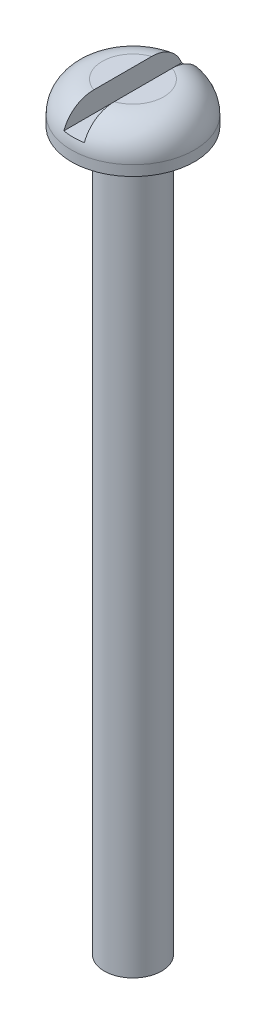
ISO-10303-21;
HEADER;
FILE_DESCRIPTION(('STEP AP214'),'2;1');
FILE_NAME('part.step','',(''),(''),'','','');
FILE_SCHEMA(('AUTOMOTIVE_DESIGN { 1 0 10303 214 1 1 1 1 }'));
ENDSEC;
DATA;
#1=APPLICATION_CONTEXT('core data for automotive mechanical design processes');
#2=APPLICATION_PROTOCOL_DEFINITION('international standard','automotive_design',2000,#1);
#3=PRODUCT_CONTEXT('',#1,'mechanical');
#4=PRODUCT('Part','Part','',(#3));
#5=PRODUCT_RELATED_PRODUCT_CATEGORY('part','',(#4));
#6=PRODUCT_DEFINITION_FORMATION('','',#4);
#7=PRODUCT_DEFINITION_CONTEXT('part definition',#1,'design');
#8=PRODUCT_DEFINITION('design','',#6,#7);
#9=PRODUCT_DEFINITION_SHAPE('','',#8);
#10=(LENGTH_UNIT() NAMED_UNIT(*) SI_UNIT(.MILLI.,.METRE.));
#11=(NAMED_UNIT(*) PLANE_ANGLE_UNIT() SI_UNIT($,.RADIAN.));
#12=(NAMED_UNIT(*) SI_UNIT($,.STERADIAN.) SOLID_ANGLE_UNIT());
#13=UNCERTAINTY_MEASURE_WITH_UNIT(LENGTH_MEASURE(1.E-05),#10,'distance_accuracy_value','');
#14=(GEOMETRIC_REPRESENTATION_CONTEXT(3) GLOBAL_UNCERTAINTY_ASSIGNED_CONTEXT((#13)) GLOBAL_UNIT_ASSIGNED_CONTEXT((#10,
#11,#12)) REPRESENTATION_CONTEXT('',''));
#15=CARTESIAN_POINT('',(0.,0.,0.));
#16=DIRECTION('',(0.,0.,1.));
#17=DIRECTION('',(1.,0.,0.));
#18=AXIS2_PLACEMENT_3D('',#15,#16,#17);
#19=CARTESIAN_POINT('',(-2.99999999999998,10.4,0.));
#20=DIRECTION('',(0.,1.,0.));
#21=DIRECTION('',(0.,0.,1.));
#22=AXIS2_PLACEMENT_3D('',#19,#20,#21);
#23=PLANE('',#22);
#24=DIRECTION('',(0.,0.,1.));
#25=VECTOR('',#24,1.);
#26=CARTESIAN_POINT('',(-1.,10.4,0.));
#27=LINE('',#26,#25);
#28=CARTESIAN_POINT('',(-1.,10.4,-2.82842712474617));
#29=VERTEX_POINT('',#28);
#30=CARTESIAN_POINT('',(-1.,10.4,2.82842712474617));
#31=VERTEX_POINT('',#30);
#32=EDGE_CURVE('E58',#29,#31,#27,.T.);
#33=ORIENTED_EDGE('',*,*,#32,.F.);
#34=CARTESIAN_POINT('',(0.,10.4,0.));
#35=DIRECTION('',(0.,1.,0.));
#36=DIRECTION('',(0.,0.,1.));
#37=AXIS2_PLACEMENT_3D('',#34,#35,#36);
#38=CIRCLE('',#37,2.99999999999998);
#39=EDGE_CURVE('E93',#29,#31,#38,.T.);
#40=ORIENTED_EDGE('',*,*,#39,.T.);
#41=EDGE_LOOP('',(#33,#40));
#42=FACE_BOUND('',#41,.T.);
#43=ADVANCED_FACE('F31',(#42),#23,.T.);
#44=CARTESIAN_POINT('',(0.,-63.6,0.));
#45=DIRECTION('',(0.,1.,0.));
#46=DIRECTION('',(0.,0.,1.));
#47=AXIS2_PLACEMENT_3D('',#44,#45,#46);
#48=CYLINDRICAL_SURFACE('',#47,2.8);
#49=CARTESIAN_POINT('',(0.,-63.6,0.));
#50=DIRECTION('',(0.,1.,0.));
#51=DIRECTION('',(0.,0.,1.));
#52=AXIS2_PLACEMENT_3D('',#49,#50,#51);
#53=CIRCLE('',#52,2.8);
#54=CARTESIAN_POINT('',(0.,-63.6,2.8));
#55=VERTEX_POINT('',#54);
#56=EDGE_CURVE('E84',#55,#55,#53,.T.);
#57=ORIENTED_EDGE('',*,*,#56,.T.);
#58=EDGE_LOOP('',(#57));
#59=FACE_BOUND('',#58,.T.);
#60=CARTESIAN_POINT('',(0.,6.4,0.));
#61=DIRECTION('',(0.,1.,0.));
#62=DIRECTION('',(0.,0.,1.));
#63=AXIS2_PLACEMENT_3D('',#60,#61,#62);
#64=CIRCLE('',#63,2.8);
#65=CARTESIAN_POINT('',(0.,6.4,2.8));
#66=VERTEX_POINT('',#65);
#67=EDGE_CURVE('E108',#66,#66,#64,.T.);
#68=ORIENTED_EDGE('',*,*,#67,.F.);
#69=EDGE_LOOP('',(#68));
#70=FACE_BOUND('',#69,.T.);
#71=ADVANCED_FACE('F33',(#59,#70),#48,.T.);
#72=CARTESIAN_POINT('',(0.,-63.6,0.));
#73=DIRECTION('',(0.,1.,0.));
#74=DIRECTION('',(0.,0.,1.));
#75=AXIS2_PLACEMENT_3D('',#72,#73,#74);
#76=PLANE('',#75);
#77=ORIENTED_EDGE('',*,*,#56,.F.);
#78=EDGE_LOOP('',(#77));
#79=FACE_BOUND('',#78,.T.);
#80=ADVANCED_FACE('F121',(#79),#76,.F.);
#81=DIRECTION('',(0.,0.,-1.));
#82=VECTOR('',#81,1.);
#83=CARTESIAN_POINT('',(1.,10.4,0.));
#84=LINE('',#83,#82);
#85=CARTESIAN_POINT('',(1.,10.4,2.82842712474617));
#86=VERTEX_POINT('',#85);
#87=CARTESIAN_POINT('',(1.,10.4,-2.82842712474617));
#88=VERTEX_POINT('',#87);
#89=EDGE_CURVE('E101',#86,#88,#84,.T.);
#90=ORIENTED_EDGE('',*,*,#89,.F.);
#91=EDGE_CURVE('E106',#86,#88,#38,.T.);
#92=ORIENTED_EDGE('',*,*,#91,.T.);
#93=EDGE_LOOP('',(#90,#92));
#94=FACE_BOUND('',#93,.T.);
#95=ADVANCED_FACE('F105',(#94),#23,.T.);
#96=CARTESIAN_POINT('',(0.,7.4,0.));
#97=DIRECTION('',(0.,1.,0.));
#98=DIRECTION('',(0.,0.,1.));
#99=AXIS2_PLACEMENT_3D('',#96,#97,#98);
#100=DEGENERATE_TOROIDAL_SURFACE('',#99,3.,3.,.T.);
#101=CARTESIAN_POINT('',(-1.,9.63606797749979,0.));
#102=CARTESIAN_POINT('',(-1.,9.63606832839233,0.0347573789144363));
#103=CARTESIAN_POINT('',(-1.,9.63770284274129,0.0695160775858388));
#104=CARTESIAN_POINT('',(-1.,9.64408287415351,0.138755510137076));
#105=CARTESIAN_POINT('',(-1.,9.6488301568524,0.173236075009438));
#106=CARTESIAN_POINT('',(-1.,9.66716719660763,0.276081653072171));
#107=CARTESIAN_POINT('',(-1.,9.68484951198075,0.343712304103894));
#108=CARTESIAN_POINT('',(-1.,9.71717923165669,0.4461027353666));
#109=CARTESIAN_POINT('',(-1.,9.72948627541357,0.48168390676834));
#110=CARTESIAN_POINT('',(-1.,9.75545837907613,0.552350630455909));
#111=CARTESIAN_POINT('',(-1.,9.76912329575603,0.587436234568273));
#112=CARTESIAN_POINT('',(-1.,9.81145913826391,0.692267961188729));
#113=CARTESIAN_POINT('',(-1.,9.84143179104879,0.761475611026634));
#114=CARTESIAN_POINT('',(-1.,9.90253859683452,0.900503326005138));
#115=CARTESIAN_POINT('',(-1.,9.93368307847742,0.970318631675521));
#116=CARTESIAN_POINT('',(-1.,9.99499645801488,1.11038321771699));
#117=CARTESIAN_POINT('',(-1.,10.0251653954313,1.18063248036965));
#118=CARTESIAN_POINT('',(-1.,10.0833182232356,1.32194271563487));
#119=CARTESIAN_POINT('',(-1.,10.1113046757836,1.39300262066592));
#120=CARTESIAN_POINT('',(-1.,10.164299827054,1.53623261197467));
#121=CARTESIAN_POINT('',(-1.,10.1893085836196,1.6084026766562));
#122=CARTESIAN_POINT('',(-1.,10.2355782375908,1.75344944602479));
#123=CARTESIAN_POINT('',(-1.,10.2568615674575,1.82631892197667));
#124=CARTESIAN_POINT('',(-1.,10.2953971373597,1.97311635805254));
#125=CARTESIAN_POINT('',(-1.,10.3126491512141,2.04704437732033));
#126=CARTESIAN_POINT('',(-1.,10.3577711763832,2.27017730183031));
#127=CARTESIAN_POINT('',(-1.,10.3790271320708,2.42079171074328));
#128=CARTESIAN_POINT('',(-1.,10.4038018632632,2.75165591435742));
#129=CARTESIAN_POINT('',(-1.,10.4033074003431,2.9322290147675));
#130=CARTESIAN_POINT('',(-1.,10.3725931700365,3.29154287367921));
#131=CARTESIAN_POINT('',(-1.,10.3422683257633,3.47027489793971));
#132=CARTESIAN_POINT('',(-1.,10.2514159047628,3.82025138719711));
#133=CARTESIAN_POINT('',(-1.,10.1908401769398,3.99148344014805));
#134=CARTESIAN_POINT('',(-1.,10.0406941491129,4.32048796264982));
#135=CARTESIAN_POINT('',(-1.,9.95116388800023,4.47827864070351));
#136=CARTESIAN_POINT('',(-1.,9.74943602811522,4.76974559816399));
#137=CARTESIAN_POINT('',(-1.,9.63823763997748,4.90411388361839));
#138=CARTESIAN_POINT('',(-1.,9.39426259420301,5.15168172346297));
#139=CARTESIAN_POINT('',(-1.,9.26148081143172,5.26487623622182));
#140=CARTESIAN_POINT('',(-1.,8.98205370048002,5.46375896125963));
#141=CARTESIAN_POINT('',(-1.,8.83587335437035,5.55010106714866));
#142=CARTESIAN_POINT('',(-1.,8.53097970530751,5.69666959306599));
#143=CARTESIAN_POINT('',(-1.,8.37226882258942,5.75690104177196));
#144=CARTESIAN_POINT('',(-1.,8.0488196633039,5.8488888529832));
#145=CARTESIAN_POINT('',(-1.,7.88417400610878,5.88097116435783));
#146=CARTESIAN_POINT('',(-1.,7.55182648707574,5.91690424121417));
#147=CARTESIAN_POINT('',(-1.,7.38412463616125,5.92075510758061));
#148=CARTESIAN_POINT('',(-1.,7.05121938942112,5.90015560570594));
#149=CARTESIAN_POINT('',(-1.,6.8860082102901,5.87583071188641));
#150=CARTESIAN_POINT('',(-1.,6.56201500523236,5.7998066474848));
#151=CARTESIAN_POINT('',(-1.,6.403232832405,5.74810810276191));
#152=CARTESIAN_POINT('',(-1.,6.09646302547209,5.61881807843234));
#153=CARTESIAN_POINT('',(-1.,5.94848281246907,5.5412089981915));
#154=CARTESIAN_POINT('',(-1.,5.66754684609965,5.36238488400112));
#155=CARTESIAN_POINT('',(-1.,5.53459196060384,5.26116848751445));
#156=CARTESIAN_POINT('',(-1.,5.28656849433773,5.0373998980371));
#157=CARTESIAN_POINT('',(-1.,5.17161437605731,4.91472090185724));
#158=CARTESIAN_POINT('',(-1.,4.96362987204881,4.65205748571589));
#159=CARTESIAN_POINT('',(-1.,4.87059580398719,4.51207597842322));
#160=CARTESIAN_POINT('',(-1.,4.70756140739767,4.21678709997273));
#161=CARTESIAN_POINT('',(-1.,4.63789724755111,4.06129462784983));
#162=CARTESIAN_POINT('',(-1.,4.52478348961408,3.74086162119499));
#163=CARTESIAN_POINT('',(-1.,4.48135615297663,3.57591319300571));
#164=CARTESIAN_POINT('',(-1.,4.43577628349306,3.32243719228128));
#165=CARTESIAN_POINT('',(-1.,4.42381973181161,3.23554798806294));
#166=CARTESIAN_POINT('',(-1.,4.40692467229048,3.06107219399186));
#167=CARTESIAN_POINT('',(-1.,4.40198614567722,2.9734856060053));
#168=CARTESIAN_POINT('',(-1.,4.39899729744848,2.79845997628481));
#169=CARTESIAN_POINT('',(-1.,4.40092695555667,2.71102124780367));
#170=CARTESIAN_POINT('',(-1.,4.4113882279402,2.53654048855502));
#171=CARTESIAN_POINT('',(-1.,4.41992057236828,2.44949850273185));
#172=CARTESIAN_POINT('',(-1.,4.44825139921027,2.23923553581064));
#173=CARTESIAN_POINT('',(-1.,4.47130585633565,2.1164462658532));
#174=CARTESIAN_POINT('',(-1.,4.52883714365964,1.87359527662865));
#175=CARTESIAN_POINT('',(-1.,4.56331696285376,1.75353427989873));
#176=CARTESIAN_POINT('',(-1.,4.62221533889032,1.5752245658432));
#177=CARTESIAN_POINT('',(-1.,4.64316696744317,1.51579395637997));
#178=CARTESIAN_POINT('',(-1.,4.68707482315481,1.3976767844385));
#179=CARTESIAN_POINT('',(-1.,4.71003106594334,1.33899022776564));
#180=CARTESIAN_POINT('',(-1.,4.75748504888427,1.22225948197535));
#181=CARTESIAN_POINT('',(-1.,4.78198258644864,1.1642152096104));
#182=CARTESIAN_POINT('',(-1.,4.83191739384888,1.04852857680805));
#183=CARTESIAN_POINT('',(-1.,4.85735476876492,0.990886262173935));
#184=CARTESIAN_POINT('',(-1.,4.90965439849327,0.872679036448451));
#185=CARTESIAN_POINT('',(-1.,4.93652245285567,0.8121167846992));
#186=CARTESIAN_POINT('',(-1.,4.98900952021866,0.69036779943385));
#187=CARTESIAN_POINT('',(-1.,5.01462730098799,0.629180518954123));
#188=CARTESIAN_POINT('',(-1.,5.06212726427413,0.506340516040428));
#189=CARTESIAN_POINT('',(-1.,5.08405778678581,0.444707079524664));
#190=CARTESIAN_POINT('',(-1.,5.12154538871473,0.31954596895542));
#191=CARTESIAN_POINT('',(-1.,5.13711852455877,0.256023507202));
#192=CARTESIAN_POINT('',(-1.,5.15343419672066,0.157569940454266));
#193=CARTESIAN_POINT('',(-1.,5.15770699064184,0.123230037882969));
#194=CARTESIAN_POINT('',(-1.,5.16313641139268,0.0542936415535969));
#195=CARTESIAN_POINT('',(-1.,5.16429281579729,0.0196971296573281));
#196=CARTESIAN_POINT('',(-1.,5.16337290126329,-0.0494804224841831));
#197=CARTESIAN_POINT('',(-1.,5.16129388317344,-0.0840614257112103));
#198=CARTESIAN_POINT('',(-1.,5.15409804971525,-0.152894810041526));
#199=CARTESIAN_POINT('',(-1.,5.14898131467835,-0.187147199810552));
#200=CARTESIAN_POINT('',(-1.,5.13015334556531,-0.286751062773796));
#201=CARTESIAN_POINT('',(-1.,5.11287417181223,-0.351418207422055));
#202=CARTESIAN_POINT('',(-1.,5.07230890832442,-0.478851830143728));
#203=CARTESIAN_POINT('',(-1.,5.04900843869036,-0.541613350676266));
#204=CARTESIAN_POINT('',(-1.,4.99913520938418,-0.66673541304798));
#205=CARTESIAN_POINT('',(-1.,4.97252384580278,-0.729080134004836));
#206=CARTESIAN_POINT('',(-1.,4.91836683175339,-0.853282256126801));
#207=CARTESIAN_POINT('',(-1.,4.89082205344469,-0.915140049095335));
#208=CARTESIAN_POINT('',(-1.,4.83624958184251,-1.0387807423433));
#209=CARTESIAN_POINT('',(-1.,4.80922021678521,-1.10056288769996));
#210=CARTESIAN_POINT('',(-1.,4.75648944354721,-1.22468685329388));
#211=CARTESIAN_POINT('',(-1.,4.73078784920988,-1.28702859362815));
#212=CARTESIAN_POINT('',(-1.,4.68138225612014,-1.41249925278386));
#213=CARTESIAN_POINT('',(-1.,4.65767803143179,-1.47562808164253));
#214=CARTESIAN_POINT('',(-1.,4.61276045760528,-1.60279691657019));
#215=CARTESIAN_POINT('',(-1.,4.59154824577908,-1.66683732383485));
#216=CARTESIAN_POINT('',(-1.,4.53266048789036,-1.85908765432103));
#217=CARTESIAN_POINT('',(-1.,4.49923620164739,-1.98864724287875));
#218=CARTESIAN_POINT('',(-1.,4.446117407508,-2.25057624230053));
#219=CARTESIAN_POINT('',(-1.,4.42641891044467,-2.38294482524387));
#220=CARTESIAN_POINT('',(-1.,4.40605842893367,-2.60646426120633));
#221=CARTESIAN_POINT('',(-1.,4.40132276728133,-2.69725619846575));
#222=CARTESIAN_POINT('',(-1.,4.39915855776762,-2.8789254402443));
#223=CARTESIAN_POINT('',(-1.,4.40172874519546,-2.96980272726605));
#224=CARTESIAN_POINT('',(-1.,4.41439313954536,-3.15129057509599));
#225=CARTESIAN_POINT('',(-1.,4.4245083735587,-3.24189967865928));
#226=CARTESIAN_POINT('',(-1.,4.45238465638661,-3.4219422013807));
#227=CARTESIAN_POINT('',(-1.,4.47014599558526,-3.511375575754));
#228=CARTESIAN_POINT('',(-1.,4.51335690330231,-3.68854041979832));
#229=CARTESIAN_POINT('',(-1.,4.53882028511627,-3.77626852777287));
#230=CARTESIAN_POINT('',(-1.,4.59734508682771,-3.94919111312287));
#231=CARTESIAN_POINT('',(-1.,4.63040939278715,-4.03438461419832));
#232=CARTESIAN_POINT('',(-1.,4.70391999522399,-4.20141723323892));
#233=CARTESIAN_POINT('',(-1.,4.74435770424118,-4.28326011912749));
#234=CARTESIAN_POINT('',(-1.,4.83237615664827,-4.44302016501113));
#235=CARTESIAN_POINT('',(-1.,4.8799594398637,-4.52093591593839));
#236=CARTESIAN_POINT('',(-1.,5.02827020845,-4.74081279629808));
#237=CARTESIAN_POINT('',(-1.,5.138074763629,-4.87681149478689));
#238=CARTESIAN_POINT('',(-1.,5.3795008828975,-5.12771781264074));
#239=CARTESIAN_POINT('',(-1.,5.51112232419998,-5.24262555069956));
#240=CARTESIAN_POINT('',(-1.,5.78847892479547,-5.44496493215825));
#241=CARTESIAN_POINT('',(-1.,5.93372445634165,-5.53306721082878));
#242=CARTESIAN_POINT('',(-1.,6.23707199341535,-5.68328014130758));
#243=CARTESIAN_POINT('',(-1.,6.39517242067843,-5.74539397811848));
#244=CARTESIAN_POINT('',(-1.,6.71768010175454,-5.84117013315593));
#245=CARTESIAN_POINT('',(-1.,6.88198785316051,-5.87516773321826));
#246=CARTESIAN_POINT('',(-1.,7.2139841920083,-5.91495403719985));
#247=CARTESIAN_POINT('',(-1.,7.38167269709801,-5.92074342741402));
#248=CARTESIAN_POINT('',(-1.,7.71484518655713,-5.90398074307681));
#249=CARTESIAN_POINT('',(-1.,7.88033578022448,-5.88155963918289));
#250=CARTESIAN_POINT('',(-1.,8.20520274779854,-5.80926441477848));
#251=CARTESIAN_POINT('',(-1.,8.36457923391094,-5.75939079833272));
#252=CARTESIAN_POINT('',(-1.,8.67280611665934,-5.63363023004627));
#253=CARTESIAN_POINT('',(-1.,8.82165106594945,-5.55772993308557));
#254=CARTESIAN_POINT('',(-1.,9.1045853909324,-5.38215097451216));
#255=CARTESIAN_POINT('',(-1.,9.23867399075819,-5.28247106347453));
#256=CARTESIAN_POINT('',(-1.,9.48917755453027,-5.06159008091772));
#257=CARTESIAN_POINT('',(-1.,9.60548349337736,-4.94026541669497));
#258=CARTESIAN_POINT('',(-1.,9.81637064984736,-4.68006511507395));
#259=CARTESIAN_POINT('',(-1.,9.91095512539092,-4.54119211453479));
#260=CARTESIAN_POINT('',(-1.,10.0772293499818,-4.24788414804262));
#261=CARTESIAN_POINT('',(-1.,10.1485929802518,-4.09326449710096));
#262=CARTESIAN_POINT('',(-1.,10.2651975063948,-3.77437481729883));
#263=CARTESIAN_POINT('',(-1.,10.3104184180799,-3.61009751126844));
#264=CARTESIAN_POINT('',(-1.,10.3751522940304,-3.27138430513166));
#265=CARTESIAN_POINT('',(-1.,10.3938375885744,-3.0967913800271));
#266=CARTESIAN_POINT('',(-1.,10.4035552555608,-2.7473165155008));
#267=CARTESIAN_POINT('',(-1.,10.3946547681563,-2.57243631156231));
#268=CARTESIAN_POINT('',(-1.,10.3580215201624,-2.27781817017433));
#269=CARTESIAN_POINT('',(-1.,10.3367107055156,-2.15721771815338));
#270=CARTESIAN_POINT('',(-1.,10.2829450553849,-1.9185127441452));
#271=CARTESIAN_POINT('',(-1.,10.2504874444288,-1.80040885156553));
#272=CARTESIAN_POINT('',(-1.,10.1759154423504,-1.56619947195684));
#273=CARTESIAN_POINT('',(-1.,10.133717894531,-1.45012102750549));
#274=CARTESIAN_POINT('',(-1.,10.0654960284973,-1.27803012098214));
#275=CARTESIAN_POINT('',(-1.,10.0419365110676,-1.22100864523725));
#276=CARTESIAN_POINT('',(-1.,9.99370728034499,-1.10742790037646));
#277=CARTESIAN_POINT('',(-1.,9.96903741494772,-1.05086869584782));
#278=CARTESIAN_POINT('',(-1.,9.91532500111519,-0.928972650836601));
#279=CARTESIAN_POINT('',(-1.,9.88621026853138,-0.863668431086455));
#280=CARTESIAN_POINT('',(-1.,9.82893394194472,-0.73252369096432));
#281=CARTESIAN_POINT('',(-1.,9.80077368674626,-0.66668256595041));
#282=CARTESIAN_POINT('',(-1.,9.74820261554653,-0.534431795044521));
#283=CARTESIAN_POINT('',(-1.,9.72374927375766,-0.468039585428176));
#284=CARTESIAN_POINT('',(-1.,9.6818989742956,-0.333081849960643));
#285=CARTESIAN_POINT('',(-1.,9.6644808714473,-0.264523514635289));
#286=CARTESIAN_POINT('',(-1.,9.64735225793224,-0.162811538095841));
#287=CARTESIAN_POINT('',(-1.,9.64315574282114,-0.130420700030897));
#288=CARTESIAN_POINT('',(-1.,9.63751175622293,-0.0653538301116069));
#289=CARTESIAN_POINT('',(-1.,9.63606764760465,-0.0326774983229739));
#290=CARTESIAN_POINT('',(-1.,9.63606797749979,0.));
#291=B_SPLINE_CURVE_WITH_KNOTS('',3,(#101,#102,#103,#104,#105,#106,#107,#108,#109,#110,#111,
#112,#113,#114,#115,#116,#117,#118,#119,#120,#121,#122,#123,#124,#125,#126,#127,#128,#129,#130,
#131,#132,#133,#134,#135,#136,#137,#138,#139,#140,#141,#142,#143,#144,#145,#146,#147,#148,#149,
#150,#151,#152,#153,#154,#155,#156,#157,#158,#159,#160,#161,#162,#163,#164,#165,#166,#167,#168,
#169,#170,#171,#172,#173,#174,#175,#176,#177,#178,#179,#180,#181,#182,#183,#184,#185,#186,#187,
#188,#189,#190,#191,#192,#193,#194,#195,#196,#197,#198,#199,#200,#201,#202,#203,#204,#205,#206,
#207,#208,#209,#210,#211,#212,#213,#214,#215,#216,#217,#218,#219,#220,#221,#222,#223,#224,#225,
#226,#227,#228,#229,#230,#231,#232,#233,#234,#235,#236,#237,#238,#239,#240,#241,#242,#243,#244,
#245,#246,#247,#248,#249,#250,#251,#252,#253,#254,#255,#256,#257,#258,#259,#260,#261,#262,#263,
#264,#265,#266,#267,#268,#269,#270,#271,#272,#273,#274,#275,#276,#277,#278,#279,#280,#281,#282,
#283,#284,#285,#286,#287,#288,#289,#290),.UNSPECIFIED.,.T.,.F.,(4,2,2,2,2,2,2,2,2,2,2,2,2,2,2,2,
2,2,2,2,2,2,2,2,2,2,2,2,2,2,2,2,2,2,2,2,2,2,2,2,2,2,2,2,2,2,2,2,2,2,2,2,2,2,2,2,2,2,2,2,2,2,2,2,
2,2,2,2,2,2,2,2,2,2,2,2,2,2,2,2,2,2,2,2,2,2,2,2,2,2,2,2,2,2,4),(0.,0.104237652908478,
0.208534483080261,0.417537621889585,0.530480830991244,0.643412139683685,0.869634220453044,
1.09898354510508,1.32832356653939,1.55739016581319,1.78645231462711,2.01408380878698,
2.2417280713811,2.69682624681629,3.23619534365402,3.77747118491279,4.31961134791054,
4.86100501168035,5.38166842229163,5.9024556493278,6.40933371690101,6.91611412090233,
7.41694580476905,7.91777569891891,8.41638380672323,8.91498051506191,9.41391660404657,
9.91288149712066,10.4149005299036,10.9168351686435,11.425707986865,11.935011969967,
12.1978990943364,12.4607855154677,12.7229062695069,12.9850560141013,13.3592114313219,
13.7334648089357,13.9224808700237,14.1114984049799,14.3004911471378,14.4895050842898,
14.6882714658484,14.8872299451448,15.0833327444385,15.2789371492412,15.3826261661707,
15.4863225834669,15.5901055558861,15.6938857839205,15.8941229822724,16.0948428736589,
16.2981722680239,16.5013166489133,16.7036178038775,16.9058905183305,17.1081403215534,
17.3104820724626,17.7112243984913,18.1118502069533,18.384330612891,18.6567638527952,
18.9299591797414,19.2031648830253,19.476863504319,19.750666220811,20.0241520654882,
20.297735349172,20.8192967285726,21.3408551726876,21.848022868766,22.3551283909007,
22.8560958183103,23.3570510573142,23.8556891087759,24.3543180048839,24.8532029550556,
25.352114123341,25.853971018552,26.3557525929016,26.8643043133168,27.3732442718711,
27.8977339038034,28.4209480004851,28.7878210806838,29.1547855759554,29.5250072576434,
29.7100892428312,29.8951966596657,30.1097037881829,30.3245002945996,30.5366077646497,
30.7480728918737,30.8459534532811,30.9439535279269),.UNSPECIFIED.);
#292=CARTESIAN_POINT('',(-1.,8.39519293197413,5.74372035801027));
#293=VERTEX_POINT('',#292);
#294=EDGE_CURVE('E11',#31,#293,#291,.T.);
#295=ORIENTED_EDGE('',*,*,#294,.F.);
#296=ORIENTED_EDGE('',*,*,#39,.F.);
#297=CARTESIAN_POINT('',(-1.,8.39519293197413,-5.74372035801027));
#298=VERTEX_POINT('',#297);
#299=EDGE_CURVE('E35',#298,#29,#291,.T.);
#300=ORIENTED_EDGE('',*,*,#299,.F.);
#301=CARTESIAN_POINT('',(0.,8.39519293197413,0.));
#302=DIRECTION('',(0.,-1.,0.));
#303=DIRECTION('',(0.,0.,-1.));
#304=AXIS2_PLACEMENT_3D('',#301,#302,#303);
#305=CIRCLE('',#304,5.83012208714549);
#306=CARTESIAN_POINT('',(1.,8.39519293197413,-5.74372035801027));
#307=VERTEX_POINT('',#306);
#308=EDGE_CURVE('E75',#307,#298,#305,.F.);
#309=ORIENTED_EDGE('',*,*,#308,.F.);
#310=CARTESIAN_POINT('',(1.,9.63606797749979,0.));
#311=CARTESIAN_POINT('',(1.,9.63606832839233,-0.0347573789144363));
#312=CARTESIAN_POINT('',(1.,9.63770284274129,-0.0695160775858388));
#313=CARTESIAN_POINT('',(1.,9.64408287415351,-0.138755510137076));
#314=CARTESIAN_POINT('',(1.,9.6488301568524,-0.173236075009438));
#315=CARTESIAN_POINT('',(1.,9.66716719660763,-0.276081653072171));
#316=CARTESIAN_POINT('',(1.,9.68484951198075,-0.343712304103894));
#317=CARTESIAN_POINT('',(1.,9.71717923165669,-0.4461027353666));
#318=CARTESIAN_POINT('',(1.,9.72948627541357,-0.48168390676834));
#319=CARTESIAN_POINT('',(1.,9.75545837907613,-0.55235063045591));
#320=CARTESIAN_POINT('',(1.,9.76912329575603,-0.587436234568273));
#321=CARTESIAN_POINT('',(1.,9.81145913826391,-0.69226796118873));
#322=CARTESIAN_POINT('',(1.,9.84143179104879,-0.761475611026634));
#323=CARTESIAN_POINT('',(1.,9.90253859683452,-0.900503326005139));
#324=CARTESIAN_POINT('',(1.,9.93368307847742,-0.970318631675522));
#325=CARTESIAN_POINT('',(1.,9.99499645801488,-1.11038321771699));
#326=CARTESIAN_POINT('',(1.,10.0251653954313,-1.18063248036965));
#327=CARTESIAN_POINT('',(1.,10.0833182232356,-1.32194271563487));
#328=CARTESIAN_POINT('',(1.,10.1113046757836,-1.39300262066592));
#329=CARTESIAN_POINT('',(1.,10.164299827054,-1.53623261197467));
#330=CARTESIAN_POINT('',(1.,10.1893085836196,-1.6084026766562));
#331=CARTESIAN_POINT('',(1.,10.2355782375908,-1.75344944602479));
#332=CARTESIAN_POINT('',(1.,10.2568615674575,-1.82631892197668));
#333=CARTESIAN_POINT('',(1.,10.2953971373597,-1.97311635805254));
#334=CARTESIAN_POINT('',(1.,10.3126491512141,-2.04704437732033));
#335=CARTESIAN_POINT('',(1.,10.3577711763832,-2.27017730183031));
#336=CARTESIAN_POINT('',(1.,10.3790271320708,-2.42079171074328));
#337=CARTESIAN_POINT('',(1.,10.4038018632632,-2.75165591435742));
#338=CARTESIAN_POINT('',(1.,10.4033074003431,-2.93222901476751));
#339=CARTESIAN_POINT('',(1.,10.3725931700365,-3.29154287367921));
#340=CARTESIAN_POINT('',(1.,10.3422683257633,-3.47027489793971));
#341=CARTESIAN_POINT('',(1.,10.2514159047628,-3.82025138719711));
#342=CARTESIAN_POINT('',(1.,10.1908401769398,-3.99148344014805));
#343=CARTESIAN_POINT('',(1.,10.0406941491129,-4.32048796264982));
#344=CARTESIAN_POINT('',(1.,9.95116388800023,-4.47827864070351));
#345=CARTESIAN_POINT('',(1.,9.74943602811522,-4.76974559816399));
#346=CARTESIAN_POINT('',(1.,9.63823763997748,-4.90411388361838));
#347=CARTESIAN_POINT('',(1.,9.39426259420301,-5.15168172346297));
#348=CARTESIAN_POINT('',(1.,9.26148081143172,-5.26487623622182));
#349=CARTESIAN_POINT('',(1.,8.98205370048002,-5.46375896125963));
#350=CARTESIAN_POINT('',(1.,8.83587335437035,-5.55010106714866));
#351=CARTESIAN_POINT('',(1.,8.53097970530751,-5.69666959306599));
#352=CARTESIAN_POINT('',(1.,8.37226882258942,-5.75690104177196));
#353=CARTESIAN_POINT('',(1.,8.0488196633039,-5.8488888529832));
#354=CARTESIAN_POINT('',(1.,7.88417400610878,-5.88097116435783));
#355=CARTESIAN_POINT('',(1.,7.55182648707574,-5.91690424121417));
#356=CARTESIAN_POINT('',(1.,7.38412463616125,-5.92075510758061));
#357=CARTESIAN_POINT('',(1.,7.05121938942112,-5.90015560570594));
#358=CARTESIAN_POINT('',(1.,6.8860082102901,-5.87583071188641));
#359=CARTESIAN_POINT('',(1.,6.56201500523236,-5.7998066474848));
#360=CARTESIAN_POINT('',(1.,6.403232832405,-5.74810810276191));
#361=CARTESIAN_POINT('',(1.,6.09646302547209,-5.61881807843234));
#362=CARTESIAN_POINT('',(1.,5.94848281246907,-5.5412089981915));
#363=CARTESIAN_POINT('',(1.,5.66754684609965,-5.36238488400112));
#364=CARTESIAN_POINT('',(1.,5.53459196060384,-5.26116848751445));
#365=CARTESIAN_POINT('',(1.,5.28656849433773,-5.0373998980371));
#366=CARTESIAN_POINT('',(1.,5.17161437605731,-4.91472090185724));
#367=CARTESIAN_POINT('',(1.,4.96362987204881,-4.6520574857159));
#368=CARTESIAN_POINT('',(1.,4.87059580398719,-4.51207597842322));
#369=CARTESIAN_POINT('',(1.,4.70756140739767,-4.21678709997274));
#370=CARTESIAN_POINT('',(1.,4.63789724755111,-4.06129462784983));
#371=CARTESIAN_POINT('',(1.,4.52478348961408,-3.74086162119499));
#372=CARTESIAN_POINT('',(1.,4.48135615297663,-3.57591319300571));
#373=CARTESIAN_POINT('',(1.,4.43577628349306,-3.32243719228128));
#374=CARTESIAN_POINT('',(1.,4.42381973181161,-3.23554798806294));
#375=CARTESIAN_POINT('',(1.,4.40692467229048,-3.06107219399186));
#376=CARTESIAN_POINT('',(1.,4.40198614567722,-2.9734856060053));
#377=CARTESIAN_POINT('',(1.,4.39899729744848,-2.79845997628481));
#378=CARTESIAN_POINT('',(1.,4.40092695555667,-2.71102124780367));
#379=CARTESIAN_POINT('',(1.,4.4113882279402,-2.53654048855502));
#380=CARTESIAN_POINT('',(1.,4.41992057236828,-2.44949850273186));
#381=CARTESIAN_POINT('',(1.,4.44825139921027,-2.23923553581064));
#382=CARTESIAN_POINT('',(1.,4.47130585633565,-2.1164462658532));
#383=CARTESIAN_POINT('',(1.,4.52883714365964,-1.87359527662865));
#384=CARTESIAN_POINT('',(1.,4.56331696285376,-1.75353427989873));
#385=CARTESIAN_POINT('',(1.,4.62221533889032,-1.57522456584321));
#386=CARTESIAN_POINT('',(1.,4.64316696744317,-1.51579395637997));
#387=CARTESIAN_POINT('',(1.,4.6870748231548,-1.3976767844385));
#388=CARTESIAN_POINT('',(1.,4.71003106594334,-1.33899022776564));
#389=CARTESIAN_POINT('',(1.,4.75748504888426,-1.22225948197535));
#390=CARTESIAN_POINT('',(1.,4.78198258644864,-1.16421520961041));
#391=CARTESIAN_POINT('',(1.,4.83191739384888,-1.04852857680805));
#392=CARTESIAN_POINT('',(1.,4.85735476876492,-0.990886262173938));
#393=CARTESIAN_POINT('',(1.,4.90965439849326,-0.872679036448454));
#394=CARTESIAN_POINT('',(1.,4.93652245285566,-0.812116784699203));
#395=CARTESIAN_POINT('',(1.,4.98900952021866,-0.690367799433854));
#396=CARTESIAN_POINT('',(1.,5.01462730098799,-0.629180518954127));
#397=CARTESIAN_POINT('',(1.,5.06212726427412,-0.506340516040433));
#398=CARTESIAN_POINT('',(1.,5.08405778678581,-0.444707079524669));
#399=CARTESIAN_POINT('',(1.,5.12154538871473,-0.319545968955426));
#400=CARTESIAN_POINT('',(1.,5.13711852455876,-0.256023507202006));
#401=CARTESIAN_POINT('',(1.,5.15343419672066,-0.157569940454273));
#402=CARTESIAN_POINT('',(1.,5.15770699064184,-0.123230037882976));
#403=CARTESIAN_POINT('',(1.,5.16313641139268,-0.054293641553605));
#404=CARTESIAN_POINT('',(1.,5.16429281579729,-0.0196971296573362));
#405=CARTESIAN_POINT('',(1.,5.16337290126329,0.0494804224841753));
#406=CARTESIAN_POINT('',(1.,5.16129388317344,0.0840614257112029));
#407=CARTESIAN_POINT('',(1.,5.15409804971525,0.152894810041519));
#408=CARTESIAN_POINT('',(1.,5.14898131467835,0.187147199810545));
#409=CARTESIAN_POINT('',(1.,5.13015334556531,0.28675106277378));
#410=CARTESIAN_POINT('',(1.,5.11287417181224,0.351418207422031));
#411=CARTESIAN_POINT('',(1.,5.07230890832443,0.478851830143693));
#412=CARTESIAN_POINT('',(1.,5.04900843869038,0.541613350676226));
#413=CARTESIAN_POINT('',(1.,4.9991352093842,0.666735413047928));
#414=CARTESIAN_POINT('',(1.,4.97252384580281,0.729080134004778));
#415=CARTESIAN_POINT('',(1.,4.91836683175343,0.85328225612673));
#416=CARTESIAN_POINT('',(1.,4.89082205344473,0.915140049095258));
#417=CARTESIAN_POINT('',(1.,4.83624958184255,1.03878074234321));
#418=CARTESIAN_POINT('',(1.,4.80922021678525,1.10056288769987));
#419=CARTESIAN_POINT('',(1.,4.75648944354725,1.22468685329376));
#420=CARTESIAN_POINT('',(1.,4.73078784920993,1.28702859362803));
#421=CARTESIAN_POINT('',(1.,4.68138225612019,1.41249925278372));
#422=CARTESIAN_POINT('',(1.,4.65767803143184,1.47562808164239));
#423=CARTESIAN_POINT('',(1.,4.61276045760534,1.60279691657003));
#424=CARTESIAN_POINT('',(1.,4.59154824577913,1.66683732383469));
#425=CARTESIAN_POINT('',(1.,4.53266048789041,1.85908765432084));
#426=CARTESIAN_POINT('',(1.,4.49923620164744,1.98864724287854));
#427=CARTESIAN_POINT('',(1.,4.44611740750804,2.2505762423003));
#428=CARTESIAN_POINT('',(1.,4.4264189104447,2.38294482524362));
#429=CARTESIAN_POINT('',(1.,4.40605842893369,2.60646426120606));
#430=CARTESIAN_POINT('',(1.,4.40132276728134,2.69725619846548));
#431=CARTESIAN_POINT('',(1.,4.39915855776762,2.87892544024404));
#432=CARTESIAN_POINT('',(1.,4.40172874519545,2.96980272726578));
#433=CARTESIAN_POINT('',(1.,4.41439313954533,3.15129057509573));
#434=CARTESIAN_POINT('',(1.,4.42450837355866,3.24189967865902));
#435=CARTESIAN_POINT('',(1.,4.45238465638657,3.42194220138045));
#436=CARTESIAN_POINT('',(1.,4.4701459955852,3.51137557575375));
#437=CARTESIAN_POINT('',(1.,4.51335690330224,3.68854041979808));
#438=CARTESIAN_POINT('',(1.,4.5388202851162,3.77626852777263));
#439=CARTESIAN_POINT('',(1.,4.59734508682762,3.94919111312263));
#440=CARTESIAN_POINT('',(1.,4.63040939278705,4.03438461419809));
#441=CARTESIAN_POINT('',(1.,4.70391999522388,4.20141723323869));
#442=CARTESIAN_POINT('',(1.,4.74435770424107,4.28326011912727));
#443=CARTESIAN_POINT('',(1.,4.83237615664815,4.44302016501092));
#444=CARTESIAN_POINT('',(1.,4.87995943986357,4.52093591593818));
#445=CARTESIAN_POINT('',(1.,5.02827020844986,4.74081279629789));
#446=CARTESIAN_POINT('',(1.,5.13807476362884,4.87681149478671));
#447=CARTESIAN_POINT('',(1.,5.37950088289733,5.12771781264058));
#448=CARTESIAN_POINT('',(1.,5.5111223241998,5.24262555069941));
#449=CARTESIAN_POINT('',(1.,5.78847892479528,5.44496493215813));
#450=CARTESIAN_POINT('',(1.,5.93372445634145,5.53306721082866));
#451=CARTESIAN_POINT('',(1.,6.23707199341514,5.68328014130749));
#452=CARTESIAN_POINT('',(1.,6.39517242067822,5.7453939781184));
#453=CARTESIAN_POINT('',(1.,6.71768010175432,5.84117013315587));
#454=CARTESIAN_POINT('',(1.,6.88198785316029,5.87516773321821));
#455=CARTESIAN_POINT('',(1.,7.21398419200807,5.91495403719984));
#456=CARTESIAN_POINT('',(1.,7.38167269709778,5.92074342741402));
#457=CARTESIAN_POINT('',(1.,7.7148451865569,5.90398074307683));
#458=CARTESIAN_POINT('',(1.,7.88033578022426,5.88155963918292));
#459=CARTESIAN_POINT('',(1.,8.20520274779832,5.80926441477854));
#460=CARTESIAN_POINT('',(1.,8.36457923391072,5.75939079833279));
#461=CARTESIAN_POINT('',(1.,8.67280611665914,5.63363023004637));
#462=CARTESIAN_POINT('',(1.,8.82165106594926,5.55772993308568));
#463=CARTESIAN_POINT('',(1.,9.10458539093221,5.38215097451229));
#464=CARTESIAN_POINT('',(1.,9.23867399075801,5.28247106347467));
#465=CARTESIAN_POINT('',(1.,9.48917755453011,5.06159008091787));
#466=CARTESIAN_POINT('',(1.,9.60548349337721,4.94026541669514));
#467=CARTESIAN_POINT('',(1.,9.81637064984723,4.68006511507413));
#468=CARTESIAN_POINT('',(1.,9.9109551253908,4.54119211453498));
#469=CARTESIAN_POINT('',(1.,10.0772293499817,4.24788414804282));
#470=CARTESIAN_POINT('',(1.,10.1485929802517,4.09326449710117));
#471=CARTESIAN_POINT('',(1.,10.2651975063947,3.77437481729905));
#472=CARTESIAN_POINT('',(1.,10.3104184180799,3.61009751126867));
#473=CARTESIAN_POINT('',(1.,10.3751522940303,3.2713843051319));
#474=CARTESIAN_POINT('',(1.,10.3938375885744,3.09679138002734));
#475=CARTESIAN_POINT('',(1.,10.4035552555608,2.74731651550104));
#476=CARTESIAN_POINT('',(1.,10.3946547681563,2.57243631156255));
#477=CARTESIAN_POINT('',(1.,10.3580215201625,2.27781817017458));
#478=CARTESIAN_POINT('',(1.,10.3367107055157,2.15721771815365));
#479=CARTESIAN_POINT('',(1.,10.282945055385,1.9185127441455));
#480=CARTESIAN_POINT('',(1.,10.2504874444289,1.80040885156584));
#481=CARTESIAN_POINT('',(1.,10.1759154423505,1.56619947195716));
#482=CARTESIAN_POINT('',(1.,10.1337178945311,1.45012102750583));
#483=CARTESIAN_POINT('',(1.,10.0654960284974,1.2780301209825));
#484=CARTESIAN_POINT('',(1.,10.0419365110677,1.22100864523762));
#485=CARTESIAN_POINT('',(1.,9.99370728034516,1.10742790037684));
#486=CARTESIAN_POINT('',(1.,9.96903741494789,1.0508686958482));
#487=CARTESIAN_POINT('',(1.,9.91532500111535,0.928972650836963));
#488=CARTESIAN_POINT('',(1.,9.88621026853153,0.863668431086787));
#489=CARTESIAN_POINT('',(1.,9.82893394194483,0.732523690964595));
#490=CARTESIAN_POINT('',(1.,9.80077368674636,0.666682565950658));
#491=CARTESIAN_POINT('',(1.,9.7482026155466,0.534431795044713));
#492=CARTESIAN_POINT('',(1.,9.72374927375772,0.468039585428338));
#493=CARTESIAN_POINT('',(1.,9.68189897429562,0.333081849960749));
#494=CARTESIAN_POINT('',(1.,9.66448087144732,0.264523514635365));
#495=CARTESIAN_POINT('',(1.,9.64735225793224,0.16281153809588));
#496=CARTESIAN_POINT('',(1.,9.64315574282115,0.130420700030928));
#497=CARTESIAN_POINT('',(1.,9.63751175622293,0.0653538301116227));
#498=CARTESIAN_POINT('',(1.,9.63606764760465,0.0326774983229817));
#499=CARTESIAN_POINT('',(1.,9.63606797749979,0.));
#500=B_SPLINE_CURVE_WITH_KNOTS('',3,(#310,#311,#312,#313,#314,#315,#316,#317,#318,#319,#320,
#321,#322,#323,#324,#325,#326,#327,#328,#329,#330,#331,#332,#333,#334,#335,#336,#337,#338,#339,
#340,#341,#342,#343,#344,#345,#346,#347,#348,#349,#350,#351,#352,#353,#354,#355,#356,#357,#358,
#359,#360,#361,#362,#363,#364,#365,#366,#367,#368,#369,#370,#371,#372,#373,#374,#375,#376,#377,
#378,#379,#380,#381,#382,#383,#384,#385,#386,#387,#388,#389,#390,#391,#392,#393,#394,#395,#396,
#397,#398,#399,#400,#401,#402,#403,#404,#405,#406,#407,#408,#409,#410,#411,#412,#413,#414,#415,
#416,#417,#418,#419,#420,#421,#422,#423,#424,#425,#426,#427,#428,#429,#430,#431,#432,#433,#434,
#435,#436,#437,#438,#439,#440,#441,#442,#443,#444,#445,#446,#447,#448,#449,#450,#451,#452,#453,
#454,#455,#456,#457,#458,#459,#460,#461,#462,#463,#464,#465,#466,#467,#468,#469,#470,#471,#472,
#473,#474,#475,#476,#477,#478,#479,#480,#481,#482,#483,#484,#485,#486,#487,#488,#489,#490,#491,
#492,#493,#494,#495,#496,#497,#498,#499),.UNSPECIFIED.,.T.,.F.,(4,2,2,2,2,2,2,2,2,2,2,2,2,2,2,2,
2,2,2,2,2,2,2,2,2,2,2,2,2,2,2,2,2,2,2,2,2,2,2,2,2,2,2,2,2,2,2,2,2,2,2,2,2,2,2,2,2,2,2,2,2,2,2,2,
2,2,2,2,2,2,2,2,2,2,2,2,2,2,2,2,2,2,2,2,2,2,2,2,2,2,2,2,2,2,4),(0.,0.104237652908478,
0.208534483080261,0.417537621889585,0.530480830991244,0.643412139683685,0.869634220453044,
1.09898354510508,1.32832356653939,1.55739016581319,1.78645231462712,2.01408380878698,
2.2417280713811,2.69682624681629,3.23619534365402,3.77747118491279,4.31961134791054,
4.86100501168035,5.38166842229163,5.9024556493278,6.40933371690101,6.91611412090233,
7.41694580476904,7.91777569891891,8.41638380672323,8.91498051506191,9.41391660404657,
9.91288149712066,10.4149005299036,10.9168351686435,11.425707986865,11.935011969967,
12.1978990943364,12.4607855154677,12.7229062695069,12.9850560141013,13.3592114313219,
13.7334648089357,13.9224808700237,14.1114984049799,14.3004911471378,14.4895050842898,
14.6882714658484,14.8872299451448,15.0833327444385,15.2789371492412,15.3826261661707,
15.4863225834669,15.5901055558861,15.6938857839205,15.8941229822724,16.0948428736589,
16.2981722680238,16.5013166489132,16.7036178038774,16.9058905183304,17.1081403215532,
17.3104820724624,17.7112243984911,18.111850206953,18.3843306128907,18.6567638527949,
18.9299591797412,19.2031648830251,19.4768635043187,19.7506662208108,20.024152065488,
20.2977353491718,20.8192967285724,21.3408551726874,21.8480228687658,22.3551283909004,
22.8560958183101,23.357051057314,23.8556891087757,24.3543180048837,24.8532029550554,
25.3521141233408,25.8539710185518,26.3557525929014,26.8643043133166,27.3732442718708,
27.8977339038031,28.4209480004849,28.7878210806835,29.1547855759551,29.525007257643,
29.7100892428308,29.8951966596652,30.1097037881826,30.3245002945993,30.5366077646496,
30.7480728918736,30.8459534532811,30.9439535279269),.UNSPECIFIED.);
#501=EDGE_CURVE('E83',#88,#307,#500,.T.);
#502=ORIENTED_EDGE('',*,*,#501,.F.);
#503=ORIENTED_EDGE('',*,*,#91,.F.);
#504=CARTESIAN_POINT('',(1.,8.39519293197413,5.74372035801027));
#505=VERTEX_POINT('',#504);
#506=EDGE_CURVE('E44',#505,#86,#500,.T.);
#507=ORIENTED_EDGE('',*,*,#506,.F.);
#508=EDGE_CURVE('E86',#293,#505,#305,.F.);
#509=ORIENTED_EDGE('',*,*,#508,.F.);
#510=EDGE_LOOP('',(#295,#296,#300,#309,#502,#503,#507,#509));
#511=FACE_BOUND('',#510,.T.);
#512=CARTESIAN_POINT('',(0.,7.39999999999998,0.));
#513=DIRECTION('',(0.,1.,0.));
#514=DIRECTION('',(0.,0.,1.));
#515=AXIS2_PLACEMENT_3D('',#512,#513,#514);
#516=CIRCLE('',#515,6.);
#517=CARTESIAN_POINT('',(0.,7.39999999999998,6.));
#518=VERTEX_POINT('',#517);
#519=EDGE_CURVE('E112',#518,#518,#516,.T.);
#520=ORIENTED_EDGE('',*,*,#519,.T.);
#521=EDGE_LOOP('',(#520));
#522=FACE_BOUND('',#521,.T.);
#523=ADVANCED_FACE('F90',(#511,#522),#100,.T.);
#524=CARTESIAN_POINT('',(0.,12.,0.));
#525=DIRECTION('',(0.,1.,0.));
#526=DIRECTION('',(0.,0.,1.));
#527=AXIS2_PLACEMENT_3D('',#524,#525,#526);
#528=CYLINDRICAL_SURFACE('',#527,6.);
#529=CARTESIAN_POINT('',(0.,6.4,0.));
#530=DIRECTION('',(0.,1.,0.));
#531=DIRECTION('',(0.,0.,1.));
#532=AXIS2_PLACEMENT_3D('',#529,#530,#531);
#533=CIRCLE('',#532,6.);
#534=CARTESIAN_POINT('',(0.,6.4,6.));
#535=VERTEX_POINT('',#534);
#536=EDGE_CURVE('E189',#535,#535,#533,.T.);
#537=ORIENTED_EDGE('',*,*,#536,.T.);
#538=EDGE_LOOP('',(#537));
#539=FACE_BOUND('',#538,.T.);
#540=ORIENTED_EDGE('',*,*,#519,.F.);
#541=EDGE_LOOP('',(#540));
#542=FACE_BOUND('',#541,.T.);
#543=ADVANCED_FACE('F137',(#539,#542),#528,.T.);
#544=CARTESIAN_POINT('',(-6.,6.4,0.));
#545=DIRECTION('',(0.,-1.,0.));
#546=DIRECTION('',(0.,0.,-1.));
#547=AXIS2_PLACEMENT_3D('',#544,#545,#546);
#548=PLANE('',#547);
#549=ORIENTED_EDGE('',*,*,#67,.T.);
#550=EDGE_LOOP('',(#549));
#551=FACE_BOUND('',#550,.T.);
#552=ORIENTED_EDGE('',*,*,#536,.F.);
#553=EDGE_LOOP('',(#552));
#554=FACE_BOUND('',#553,.T.);
#555=ADVANCED_FACE('F140',(#551,#554),#548,.T.);
#556=CARTESIAN_POINT('',(-1.,8.39519293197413,-6.5));
#557=DIRECTION('',(-1.,0.,0.));
#558=DIRECTION('',(0.,-1.,0.));
#559=AXIS2_PLACEMENT_3D('',#556,#557,#558);
#560=PLANE('',#559);
#561=ORIENTED_EDGE('',*,*,#294,.T.);
#562=DIRECTION('',(0.,0.,1.));
#563=VECTOR('',#562,1.);
#564=CARTESIAN_POINT('',(-1.,8.39519293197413,-6.5));
#565=LINE('',#564,#563);
#566=EDGE_CURVE('E78',#298,#293,#565,.T.);
#567=ORIENTED_EDGE('',*,*,#566,.F.);
#568=ORIENTED_EDGE('',*,*,#299,.T.);
#569=ORIENTED_EDGE('',*,*,#32,.T.);
#570=EDGE_LOOP('',(#561,#567,#568,#569));
#571=FACE_BOUND('',#570,.T.);
#572=ADVANCED_FACE('F87',(#571),#560,.F.);
#573=CARTESIAN_POINT('',(1.,8.39519293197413,-6.5));
#574=DIRECTION('',(1.,0.,0.));
#575=DIRECTION('',(0.,0.,-1.));
#576=AXIS2_PLACEMENT_3D('',#573,#574,#575);
#577=PLANE('',#576);
#578=ORIENTED_EDGE('',*,*,#501,.T.);
#579=DIRECTION('',(0.,0.,1.));
#580=VECTOR('',#579,1.);
#581=CARTESIAN_POINT('',(1.,8.39519293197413,-6.5));
#582=LINE('',#581,#580);
#583=EDGE_CURVE('E51',#307,#505,#582,.T.);
#584=ORIENTED_EDGE('',*,*,#583,.T.);
#585=ORIENTED_EDGE('',*,*,#506,.T.);
#586=ORIENTED_EDGE('',*,*,#89,.T.);
#587=EDGE_LOOP('',(#578,#584,#585,#586));
#588=FACE_BOUND('',#587,.T.);
#589=ADVANCED_FACE('F100',(#588),#577,.F.);
#590=CARTESIAN_POINT('',(-1.,8.39519293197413,-6.5));
#591=DIRECTION('',(0.,-1.,0.));
#592=DIRECTION('',(0.,0.,-1.));
#593=AXIS2_PLACEMENT_3D('',#590,#591,#592);
#594=PLANE('',#593);
#595=ORIENTED_EDGE('',*,*,#508,.T.);
#596=ORIENTED_EDGE('',*,*,#583,.F.);
#597=ORIENTED_EDGE('',*,*,#308,.T.);
#598=ORIENTED_EDGE('',*,*,#566,.T.);
#599=EDGE_LOOP('',(#595,#596,#597,#598));
#600=FACE_BOUND('',#599,.T.);
#601=ADVANCED_FACE('F77',(#600),#594,.F.);
#602=CLOSED_SHELL('',(#43,#71,#80,#95,#523,#543,#555,#572,#589,#601));
#603=MANIFOLD_SOLID_BREP('B2',#602);
#604=ADVANCED_BREP_SHAPE_REPRESENTATION('',(#18,#603),#14);
#605=SHAPE_DEFINITION_REPRESENTATION(#9,#604);
ENDSEC;
END-ISO-10303-21;
